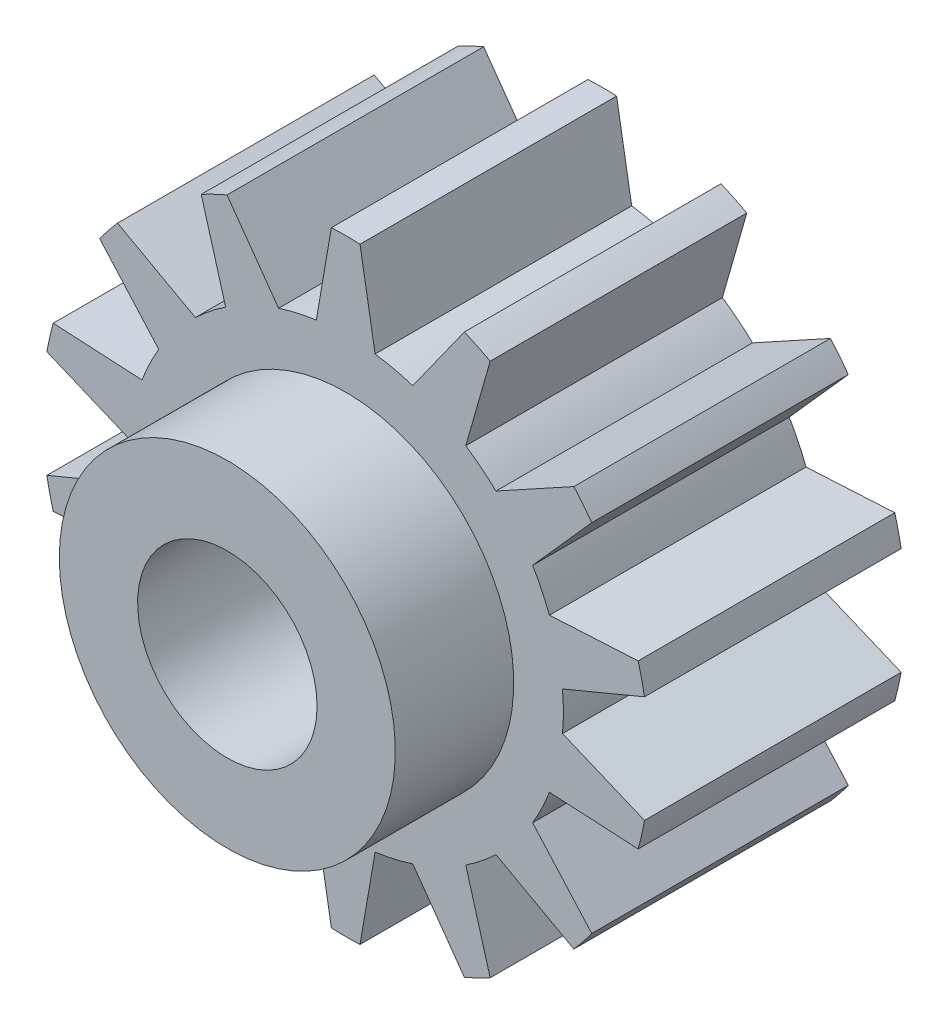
from build123d import *

# Parameters (mm, degrees)
SKETCH1_R              = 5.7
MOTOR_GEAR_SHAPE_DEPTH = 6.72
MOTOR_START            = -6.72
MOTOR_GEAR_TOOTH_DEPTH = 6.72
MOTOR_GEAR_TEETH_COUNT = 14
MOTOR_GEAR_TEETH_ANGLE = 334.28577
SKETCH3_R              = 4.4
SKETCH3_R_2            = 2.35
MOTOR_GEAR_BOSS_DEPTH  = 3.1
SKETCH4_R              = 2.35
MOTOR_SHAFT_HOLE_DEPTH = 15.861806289
MOTOR_SHAFT_FLAT_DEPTH = 4.9


with BuildPart() as part:
    # Sketch1 → motor gear shape (new body)
    with BuildSketch(Plane.XY):
        Circle(SKETCH1_R)
    extrude(amount=MOTOR_GEAR_SHAPE_DEPTH)

    # Sketch2 → motor gear tooth (add)
    with BuildSketch(Plane.XY.offset(6.72).offset(MOTOR_START)):
        with BuildLine():
            Line((0.375, 7.941150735), (0.77, 5.647751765))
            ThreePointArc((0.77, 5.647751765), (0, 5.7), (-0.77, 5.647751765))
            Line((-0.77, 5.647751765), (-0.375, 7.941150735))
            ThreePointArc((-0.375, 7.941150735), (0, 7.95), (0.375, 7.941150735))
        make_face()
    motor_gear_tooth = extrude(amount=MOTOR_GEAR_TOOTH_DEPTH)

    # motor gear teeth: motor gear tooth ×14 about axis
    motor_gear_teeth_axis = Axis((0, 0, 0), (0, 0, -1))
    for i in range(1, MOTOR_GEAR_TEETH_COUNT):
        add(motor_gear_tooth.rotate(motor_gear_teeth_axis, i * MOTOR_GEAR_TEETH_ANGLE / (MOTOR_GEAR_TEETH_COUNT - 1)))

    # Sketch3 → motor gear boss (add)
    with BuildSketch(Plane.XY.offset(6.72)):
        with Locations(Location((0, 0, 0), (0, 0, 180))):
            Circle(SKETCH3_R)
        with Locations(Location((0, 0, 0), (0, 0, 212.134928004))):
            Circle(SKETCH3_R_2, mode=Mode.SUBTRACT)
    extrude(amount=MOTOR_GEAR_BOSS_DEPTH)

    # Sketch4 → motor shaft hole (cut, through all)
    with BuildSketch(Plane.XY.offset(9.82)):
        with Locations(Location((0, 0, 0), (0, 0, 212.134928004))):
            Circle(SKETCH4_R)
    extrude(amount=-MOTOR_SHAFT_HOLE_DEPTH, mode=Mode.SUBTRACT)

    # Sketch5 → motor shaft flat (add)
    with BuildSketch(Plane(origin=(0, 0, 0), x_dir=(-1, 0, 0), z_dir=(0, 0, -1))):
        with BuildLine():
            Line((-3.108054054, -1.25), (3.108054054, -1.25))
            ThreePointArc((3.108054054, -1.25), (0, -3.35), (-3.108054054, -1.25))
        make_face()
    extrude(amount=-MOTOR_SHAFT_FLAT_DEPTH)


solid = part.part
